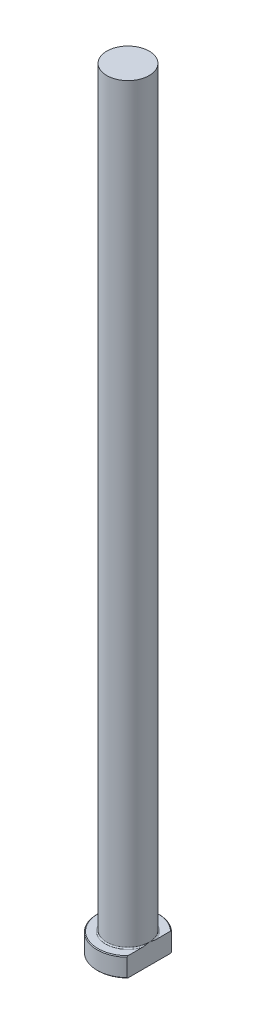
from build123d import *
from build123d.topology import SkipClean

# Parameters (mm, degrees)
CHAMFER1_SIZE = 0.2
FILLET1_R     = 0.3
KEY_DEPTH     = 201.319744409


with BuildPart() as part:
    # Sketch1 → Revolve1 (revolve)
    with BuildSketch(Plane.XY, mode=Mode.PRIVATE) as revolve1_sk:
        Polygon((0, 0), (-8, 0), (-8, 5), (-5.5, 5), (-5.5, 200), (0, 200), align=None)
    revolve(revolve1_sk.sketch.rotate(Axis((0, 259.958771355, 0), (0, -1, 0)), 270), axis=Axis((0, 259.958771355, 0), (0, -1, 0)))

    # Chamfer1
    chamfer1_edges = [part.edges().sort_by_distance(p)[0] for p in [
        (0, 5, -8),
        (0, 0, -8),
    ]]
    chamfer(chamfer1_edges, length=CHAMFER1_SIZE)

    # Fillet1
    fillet1_edges = [part.edges().sort_by_distance(p)[0] for p in [
        (0, 5, -5.5),
    ]]
    fillet(fillet1_edges, radius=FILLET1_R)

    # Sketch2 → KEY (cut, through all)
    with SkipClean():  # the faces are left unmerged after this step: merging them gives an invalid solid
        with BuildSketch(Plane(origin=(0, 0, 0), x_dir=(1, 0, 0), z_dir=(0, 1, 0))):
            with BuildLine():
                Line((5.5, 5.809475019), (5.5, -5.809475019))
                ThreePointArc((5.5, -5.809475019), (8, 0), (5.5, 5.809475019))
            make_face()
        extrude(amount=KEY_DEPTH, mode=Mode.SUBTRACT)


solid = part.part
